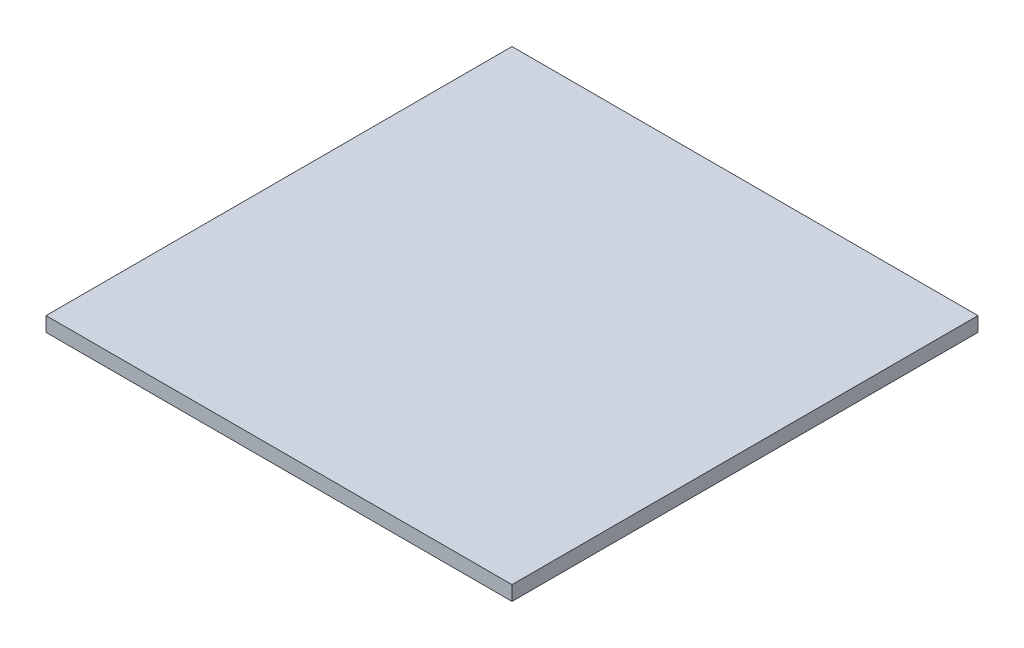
ISO-10303-21;
HEADER;
FILE_DESCRIPTION(('STEP AP214'),'2;1');
FILE_NAME('part.step','',(''),(''),'','','');
FILE_SCHEMA(('AUTOMOTIVE_DESIGN { 1 0 10303 214 1 1 1 1 }'));
ENDSEC;
DATA;
#1=APPLICATION_CONTEXT('core data for automotive mechanical design processes');
#2=APPLICATION_PROTOCOL_DEFINITION('international standard','automotive_design',2000,#1);
#3=PRODUCT_CONTEXT('',#1,'mechanical');
#4=PRODUCT('Part','Part','',(#3));
#5=PRODUCT_RELATED_PRODUCT_CATEGORY('part','',(#4));
#6=PRODUCT_DEFINITION_FORMATION('','',#4);
#7=PRODUCT_DEFINITION_CONTEXT('part definition',#1,'design');
#8=PRODUCT_DEFINITION('design','',#6,#7);
#9=PRODUCT_DEFINITION_SHAPE('','',#8);
#10=(LENGTH_UNIT() NAMED_UNIT(*) SI_UNIT(.MILLI.,.METRE.));
#11=(NAMED_UNIT(*) PLANE_ANGLE_UNIT() SI_UNIT($,.RADIAN.));
#12=(NAMED_UNIT(*) SI_UNIT($,.STERADIAN.) SOLID_ANGLE_UNIT());
#13=UNCERTAINTY_MEASURE_WITH_UNIT(LENGTH_MEASURE(1.E-05),#10,'distance_accuracy_value','');
#14=(GEOMETRIC_REPRESENTATION_CONTEXT(3) GLOBAL_UNCERTAINTY_ASSIGNED_CONTEXT((#13)) GLOBAL_UNIT_ASSIGNED_CONTEXT((#10,
#11,#12)) REPRESENTATION_CONTEXT('',''));
#15=CARTESIAN_POINT('',(0.,0.,0.));
#16=DIRECTION('',(0.,0.,1.));
#17=DIRECTION('',(1.,0.,0.));
#18=AXIS2_PLACEMENT_3D('',#15,#16,#17);
#19=CARTESIAN_POINT('',(-203.2,12.7,-203.2));
#20=DIRECTION('',(1.,0.,0.));
#21=DIRECTION('',(0.,0.,-1.));
#22=AXIS2_PLACEMENT_3D('',#19,#20,#21);
#23=PLANE('',#22);
#24=DIRECTION('',(0.,0.,1.));
#25=VECTOR('',#24,1.);
#26=CARTESIAN_POINT('',(-203.2,0.,-203.2));
#27=LINE('',#26,#25);
#28=CARTESIAN_POINT('',(-203.2,0.,-203.2));
#29=VERTEX_POINT('',#28);
#30=CARTESIAN_POINT('',(-203.2,0.,203.2));
#31=VERTEX_POINT('',#30);
#32=EDGE_CURVE('E94',#29,#31,#27,.T.);
#33=ORIENTED_EDGE('',*,*,#32,.T.);
#34=DIRECTION('',(0.,-1.,0.));
#35=VECTOR('',#34,1.);
#36=CARTESIAN_POINT('',(-203.2,12.7,203.2));
#37=LINE('',#36,#35);
#38=CARTESIAN_POINT('',(-203.2,12.7,203.2));
#39=VERTEX_POINT('',#38);
#40=EDGE_CURVE('E11',#39,#31,#37,.T.);
#41=ORIENTED_EDGE('',*,*,#40,.F.);
#42=DIRECTION('',(0.,0.,1.));
#43=VECTOR('',#42,1.);
#44=CARTESIAN_POINT('',(-203.2,12.7,-203.2));
#45=LINE('',#44,#43);
#46=CARTESIAN_POINT('',(-203.2,12.7,-203.2));
#47=VERTEX_POINT('',#46);
#48=EDGE_CURVE('E82',#47,#39,#45,.T.);
#49=ORIENTED_EDGE('',*,*,#48,.F.);
#50=DIRECTION('',(0.,-1.,0.));
#51=VECTOR('',#50,1.);
#52=CARTESIAN_POINT('',(-203.2,12.7,-203.2));
#53=LINE('',#52,#51);
#54=EDGE_CURVE('E90',#47,#29,#53,.T.);
#55=ORIENTED_EDGE('',*,*,#54,.T.);
#56=EDGE_LOOP('',(#33,#41,#49,#55));
#57=FACE_BOUND('',#56,.T.);
#58=ADVANCED_FACE('F31',(#57),#23,.F.);
#59=CARTESIAN_POINT('',(-203.2,12.7,203.2));
#60=DIRECTION('',(0.,0.,-1.));
#61=DIRECTION('',(-1.,0.,0.));
#62=AXIS2_PLACEMENT_3D('',#59,#60,#61);
#63=PLANE('',#62);
#64=DIRECTION('',(1.,0.,0.));
#65=VECTOR('',#64,1.);
#66=CARTESIAN_POINT('',(-203.2,0.,203.2));
#67=LINE('',#66,#65);
#68=CARTESIAN_POINT('',(203.2,0.,203.2));
#69=VERTEX_POINT('',#68);
#70=EDGE_CURVE('E86',#31,#69,#67,.T.);
#71=ORIENTED_EDGE('',*,*,#70,.T.);
#72=DIRECTION('',(0.,-1.,0.));
#73=VECTOR('',#72,1.);
#74=CARTESIAN_POINT('',(203.2,12.7,203.2));
#75=LINE('',#74,#73);
#76=CARTESIAN_POINT('',(203.2,12.7,203.2));
#77=VERTEX_POINT('',#76);
#78=EDGE_CURVE('E39',#77,#69,#75,.T.);
#79=ORIENTED_EDGE('',*,*,#78,.F.);
#80=DIRECTION('',(1.,0.,0.));
#81=VECTOR('',#80,1.);
#82=CARTESIAN_POINT('',(-203.2,12.7,203.2));
#83=LINE('',#82,#81);
#84=EDGE_CURVE('E77',#39,#77,#83,.T.);
#85=ORIENTED_EDGE('',*,*,#84,.F.);
#86=ORIENTED_EDGE('',*,*,#40,.T.);
#87=EDGE_LOOP('',(#71,#79,#85,#86));
#88=FACE_BOUND('',#87,.T.);
#89=ADVANCED_FACE('F85',(#88),#63,.F.);
#90=CARTESIAN_POINT('',(203.2,12.7,-203.2));
#91=DIRECTION('',(-1.,0.,0.));
#92=DIRECTION('',(0.,0.,1.));
#93=AXIS2_PLACEMENT_3D('',#90,#91,#92);
#94=PLANE('',#93);
#95=DIRECTION('',(0.,0.,-1.));
#96=VECTOR('',#95,1.);
#97=CARTESIAN_POINT('',(203.2,0.,-203.2));
#98=LINE('',#97,#96);
#99=CARTESIAN_POINT('',(203.2,0.,-203.2));
#100=VERTEX_POINT('',#99);
#101=EDGE_CURVE('E64',#69,#100,#98,.T.);
#102=ORIENTED_EDGE('',*,*,#101,.T.);
#103=DIRECTION('',(0.,-1.,0.));
#104=VECTOR('',#103,1.);
#105=CARTESIAN_POINT('',(203.2,12.7,-203.2));
#106=LINE('',#105,#104);
#107=CARTESIAN_POINT('',(203.2,12.7,-203.2));
#108=VERTEX_POINT('',#107);
#109=EDGE_CURVE('E87',#108,#100,#106,.T.);
#110=ORIENTED_EDGE('',*,*,#109,.F.);
#111=DIRECTION('',(0.,0.,-1.));
#112=VECTOR('',#111,1.);
#113=CARTESIAN_POINT('',(203.2,12.7,-203.2));
#114=LINE('',#113,#112);
#115=EDGE_CURVE('E80',#77,#108,#114,.T.);
#116=ORIENTED_EDGE('',*,*,#115,.F.);
#117=ORIENTED_EDGE('',*,*,#78,.T.);
#118=EDGE_LOOP('',(#102,#110,#116,#117));
#119=FACE_BOUND('',#118,.T.);
#120=ADVANCED_FACE('F88',(#119),#94,.F.);
#121=CARTESIAN_POINT('',(-203.2,12.7,-203.2));
#122=DIRECTION('',(0.,0.,1.));
#123=DIRECTION('',(1.,0.,0.));
#124=AXIS2_PLACEMENT_3D('',#121,#122,#123);
#125=PLANE('',#124);
#126=DIRECTION('',(-1.,0.,0.));
#127=VECTOR('',#126,1.);
#128=CARTESIAN_POINT('',(-203.2,0.,-203.2));
#129=LINE('',#128,#127);
#130=EDGE_CURVE('E70',#100,#29,#129,.T.);
#131=ORIENTED_EDGE('',*,*,#130,.T.);
#132=ORIENTED_EDGE('',*,*,#54,.F.);
#133=DIRECTION('',(-1.,0.,0.));
#134=VECTOR('',#133,1.);
#135=CARTESIAN_POINT('',(-203.2,12.7,-203.2));
#136=LINE('',#135,#134);
#137=EDGE_CURVE('E47',#108,#47,#136,.T.);
#138=ORIENTED_EDGE('',*,*,#137,.F.);
#139=ORIENTED_EDGE('',*,*,#109,.T.);
#140=EDGE_LOOP('',(#131,#132,#138,#139));
#141=FACE_BOUND('',#140,.T.);
#142=ADVANCED_FACE('F101',(#141),#125,.F.);
#143=CARTESIAN_POINT('',(-203.2,12.7,203.2));
#144=DIRECTION('',(0.,1.,0.));
#145=DIRECTION('',(0.,0.,1.));
#146=AXIS2_PLACEMENT_3D('',#143,#144,#145);
#147=PLANE('',#146);
#148=ORIENTED_EDGE('',*,*,#48,.T.);
#149=ORIENTED_EDGE('',*,*,#84,.T.);
#150=ORIENTED_EDGE('',*,*,#115,.T.);
#151=ORIENTED_EDGE('',*,*,#137,.T.);
#152=EDGE_LOOP('',(#148,#149,#150,#151));
#153=FACE_BOUND('',#152,.T.);
#154=ADVANCED_FACE('F78',(#153),#147,.T.);
#155=CARTESIAN_POINT('',(-203.2,0.,203.2));
#156=DIRECTION('',(0.,1.,0.));
#157=DIRECTION('',(0.,0.,1.));
#158=AXIS2_PLACEMENT_3D('',#155,#156,#157);
#159=PLANE('',#158);
#160=ORIENTED_EDGE('',*,*,#32,.F.);
#161=ORIENTED_EDGE('',*,*,#130,.F.);
#162=ORIENTED_EDGE('',*,*,#101,.F.);
#163=ORIENTED_EDGE('',*,*,#70,.F.);
#164=EDGE_LOOP('',(#160,#161,#162,#163));
#165=FACE_BOUND('',#164,.T.);
#166=ADVANCED_FACE('F104',(#165),#159,.F.);
#167=CLOSED_SHELL('',(#58,#89,#120,#142,#154,#166));
#168=MANIFOLD_SOLID_BREP('B2',#167);
#169=ADVANCED_BREP_SHAPE_REPRESENTATION('',(#18,#168),#14);
#170=SHAPE_DEFINITION_REPRESENTATION(#9,#169);
ENDSEC;
END-ISO-10303-21;
